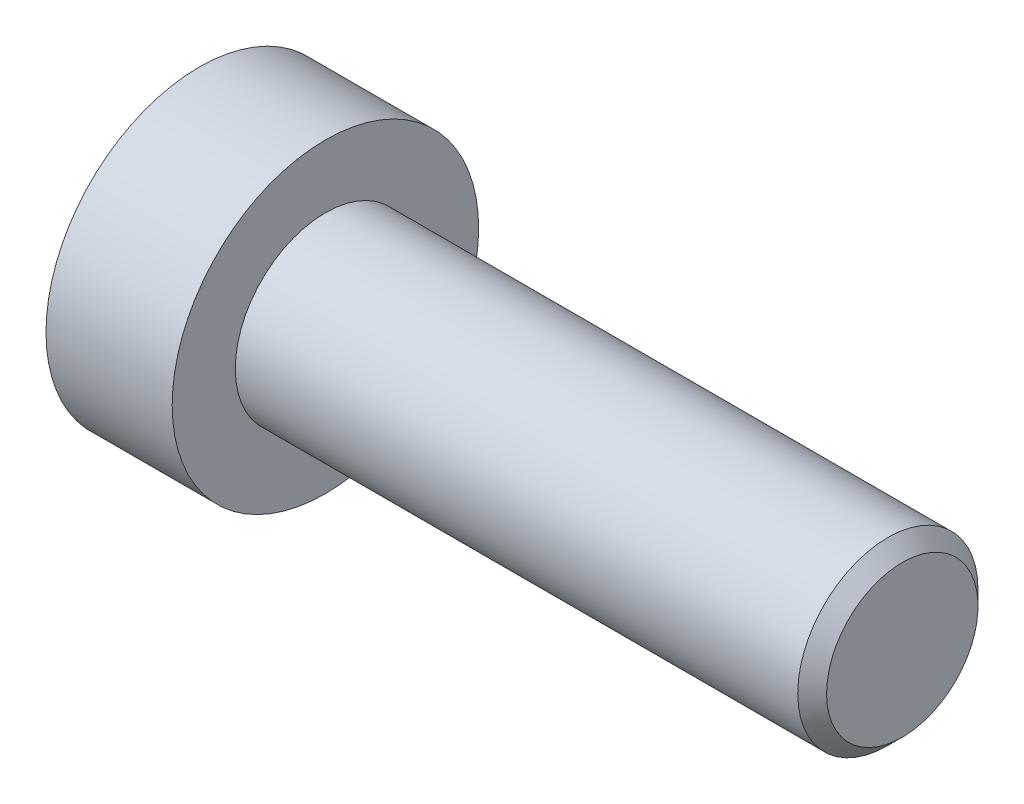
ISO-10303-21;
HEADER;
FILE_DESCRIPTION(('STEP AP214'),'2;1');
FILE_NAME('part.step','',(''),(''),'','','');
FILE_SCHEMA(('AUTOMOTIVE_DESIGN { 1 0 10303 214 1 1 1 1 }'));
ENDSEC;
DATA;
#1=APPLICATION_CONTEXT('core data for automotive mechanical design processes');
#2=APPLICATION_PROTOCOL_DEFINITION('international standard','automotive_design',2000,#1);
#3=PRODUCT_CONTEXT('',#1,'mechanical');
#4=PRODUCT('Part','Part','',(#3));
#5=PRODUCT_RELATED_PRODUCT_CATEGORY('part','',(#4));
#6=PRODUCT_DEFINITION_FORMATION('','',#4);
#7=PRODUCT_DEFINITION_CONTEXT('part definition',#1,'design');
#8=PRODUCT_DEFINITION('design','',#6,#7);
#9=PRODUCT_DEFINITION_SHAPE('','',#8);
#10=(LENGTH_UNIT() NAMED_UNIT(*) SI_UNIT(.MILLI.,.METRE.));
#11=(NAMED_UNIT(*) PLANE_ANGLE_UNIT() SI_UNIT($,.RADIAN.));
#12=(NAMED_UNIT(*) SI_UNIT($,.STERADIAN.) SOLID_ANGLE_UNIT());
#13=UNCERTAINTY_MEASURE_WITH_UNIT(LENGTH_MEASURE(1.E-05),#10,'distance_accuracy_value','');
#14=(GEOMETRIC_REPRESENTATION_CONTEXT(3) GLOBAL_UNCERTAINTY_ASSIGNED_CONTEXT((#13)) GLOBAL_UNIT_ASSIGNED_CONTEXT((#10,
#11,#12)) REPRESENTATION_CONTEXT('',''));
#15=CARTESIAN_POINT('',(0.,0.,0.));
#16=DIRECTION('',(0.,0.,1.));
#17=DIRECTION('',(1.,0.,0.));
#18=AXIS2_PLACEMENT_3D('',#15,#16,#17);
#19=CARTESIAN_POINT('',(-100.707422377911,37.694020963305,-9.09741678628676));
#20=DIRECTION('',(-1.,0.,0.));
#21=DIRECTION('',(0.,0.,1.));
#22=AXIS2_PLACEMENT_3D('',#19,#20,#21);
#23=CYLINDRICAL_SURFACE('',#22,0.394);
#24=CARTESIAN_POINT('',(-77.8,37.694020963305,-9.09741678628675));
#25=DIRECTION('',(-1.,0.,0.));
#26=DIRECTION('',(0.,0.,1.));
#27=AXIS2_PLACEMENT_3D('',#24,#25,#26);
#28=CIRCLE('',#27,0.394);
#29=CARTESIAN_POINT('',(-77.8,38.0713365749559,-8.98397548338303));
#30=VERTEX_POINT('',#29);
#31=CARTESIAN_POINT('',(-77.8,37.4071201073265,-9.36746103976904));
#32=VERTEX_POINT('',#31);
#33=EDGE_CURVE('E120',#30,#32,#28,.T.);
#34=ORIENTED_EDGE('',*,*,#33,.F.);
#35=DIRECTION('',(-1.,0.,0.));
#36=VECTOR('',#35,1.);
#37=CARTESIAN_POINT('',(-100.707422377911,38.0713365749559,-8.98397548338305));
#38=LINE('',#37,#36);
#39=CARTESIAN_POINT('',(-79.5,38.0713365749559,-8.98397548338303));
#40=VERTEX_POINT('',#39);
#41=EDGE_CURVE('E119',#40,#30,#38,.F.);
#42=ORIENTED_EDGE('',*,*,#41,.F.);
#43=CARTESIAN_POINT('',(-79.5,37.694020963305,-9.09741678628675));
#44=DIRECTION('',(-1.,0.,0.));
#45=DIRECTION('',(0.,0.,1.));
#46=AXIS2_PLACEMENT_3D('',#43,#44,#45);
#47=CIRCLE('',#46,0.394);
#48=CARTESIAN_POINT('',(-79.5,37.4071201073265,-9.36746103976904));
#49=VERTEX_POINT('',#48);
#50=EDGE_CURVE('E21',#49,#40,#47,.F.);
#51=ORIENTED_EDGE('',*,*,#50,.F.);
#52=DIRECTION('',(-1.,0.,0.));
#53=VECTOR('',#52,1.);
#54=CARTESIAN_POINT('',(-100.707422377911,37.4071201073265,-9.36746103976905));
#55=LINE('',#54,#53);
#56=EDGE_CURVE('E125',#32,#49,#55,.T.);
#57=ORIENTED_EDGE('',*,*,#56,.F.);
#58=EDGE_LOOP('',(#34,#42,#51,#57));
#59=FACE_BOUND('',#58,.T.);
#60=ADVANCED_FACE('F17',(#59),#23,.F.);
#61=CARTESIAN_POINT('',(-100.707422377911,38.482020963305,-7.73256074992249));
#62=DIRECTION('',(-1.,0.,0.));
#63=DIRECTION('',(0.,0.,1.));
#64=AXIS2_PLACEMENT_3D('',#61,#62,#63);
#65=CYLINDRICAL_SURFACE('',#64,0.394);
#66=CARTESIAN_POINT('',(-77.8,38.482020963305,-7.73256074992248));
#67=DIRECTION('',(-1.,0.,0.));
#68=DIRECTION('',(0.,0.,1.));
#69=AXIS2_PLACEMENT_3D('',#66,#67,#68);
#70=CIRCLE('',#69,0.394);
#71=CARTESIAN_POINT('',(-77.8,38.5724357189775,-7.34907519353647));
#72=VERTEX_POINT('',#71);
#73=CARTESIAN_POINT('',(-77.8,38.5724357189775,-8.11604630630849));
#74=VERTEX_POINT('',#73);
#75=EDGE_CURVE('E164',#72,#74,#70,.T.);
#76=ORIENTED_EDGE('',*,*,#75,.F.);
#77=DIRECTION('',(-1.,0.,0.));
#78=VECTOR('',#77,1.);
#79=CARTESIAN_POINT('',(-100.707422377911,38.5724357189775,-7.34907519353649));
#80=LINE('',#79,#78);
#81=CARTESIAN_POINT('',(-79.5,38.5724357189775,-7.34907519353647));
#82=VERTEX_POINT('',#81);
#83=EDGE_CURVE('E159',#82,#72,#80,.F.);
#84=ORIENTED_EDGE('',*,*,#83,.F.);
#85=CARTESIAN_POINT('',(-79.5,38.482020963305,-7.73256074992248));
#86=DIRECTION('',(-1.,0.,0.));
#87=DIRECTION('',(0.,0.,1.));
#88=AXIS2_PLACEMENT_3D('',#85,#86,#87);
#89=CIRCLE('',#88,0.394);
#90=CARTESIAN_POINT('',(-79.5,38.5724357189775,-8.11604630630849));
#91=VERTEX_POINT('',#90);
#92=EDGE_CURVE('E117',#91,#82,#89,.F.);
#93=ORIENTED_EDGE('',*,*,#92,.F.);
#94=DIRECTION('',(-1.,0.,0.));
#95=VECTOR('',#94,1.);
#96=CARTESIAN_POINT('',(-100.707422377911,38.5724357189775,-8.11604630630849));
#97=LINE('',#96,#95);
#98=EDGE_CURVE('E130',#74,#91,#97,.T.);
#99=ORIENTED_EDGE('',*,*,#98,.F.);
#100=EDGE_LOOP('',(#76,#84,#93,#99));
#101=FACE_BOUND('',#100,.T.);
#102=ADVANCED_FACE('F182',(#101),#65,.F.);
#103=CARTESIAN_POINT('',(-100.707422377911,37.694020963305,-6.36770471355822));
#104=DIRECTION('',(-1.,0.,0.));
#105=DIRECTION('',(0.,0.,1.));
#106=AXIS2_PLACEMENT_3D('',#103,#104,#105);
#107=CYLINDRICAL_SURFACE('',#106,0.394);
#108=CARTESIAN_POINT('',(-77.8,37.694020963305,-6.36770471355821));
#109=DIRECTION('',(-1.,0.,0.));
#110=DIRECTION('',(0.,0.,1.));
#111=AXIS2_PLACEMENT_3D('',#108,#109,#110);
#112=CIRCLE('',#111,0.394);
#113=CARTESIAN_POINT('',(-77.8,37.4071201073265,-6.0976604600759));
#114=VERTEX_POINT('',#113);
#115=CARTESIAN_POINT('',(-77.8,38.0713365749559,-6.48114601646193));
#116=VERTEX_POINT('',#115);
#117=EDGE_CURVE('E166',#114,#116,#112,.T.);
#118=ORIENTED_EDGE('',*,*,#117,.F.);
#119=DIRECTION('',(-1.,0.,0.));
#120=VECTOR('',#119,1.);
#121=CARTESIAN_POINT('',(-100.707422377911,37.4071201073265,-6.09766046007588));
#122=LINE('',#121,#120);
#123=CARTESIAN_POINT('',(-79.5,37.4071201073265,-6.0976604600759));
#124=VERTEX_POINT('',#123);
#125=EDGE_CURVE('E154',#124,#114,#122,.F.);
#126=ORIENTED_EDGE('',*,*,#125,.F.);
#127=CARTESIAN_POINT('',(-79.5,37.694020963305,-6.36770471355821));
#128=DIRECTION('',(-1.,0.,0.));
#129=DIRECTION('',(0.,0.,1.));
#130=AXIS2_PLACEMENT_3D('',#127,#128,#129);
#131=CIRCLE('',#130,0.394);
#132=CARTESIAN_POINT('',(-79.5,38.0713365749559,-6.48114601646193));
#133=VERTEX_POINT('',#132);
#134=EDGE_CURVE('E177',#133,#124,#131,.F.);
#135=ORIENTED_EDGE('',*,*,#134,.F.);
#136=DIRECTION('',(-1.,0.,0.));
#137=VECTOR('',#136,1.);
#138=CARTESIAN_POINT('',(-100.707422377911,38.0713365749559,-6.48114601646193));
#139=LINE('',#138,#137);
#140=EDGE_CURVE('E158',#116,#133,#139,.T.);
#141=ORIENTED_EDGE('',*,*,#140,.F.);
#142=EDGE_LOOP('',(#118,#126,#135,#141));
#143=FACE_BOUND('',#142,.T.);
#144=ADVANCED_FACE('F255',(#143),#107,.F.);
#145=CARTESIAN_POINT('',(-100.707422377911,36.1180209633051,-6.36770471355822));
#146=DIRECTION('',(-1.,0.,0.));
#147=DIRECTION('',(0.,0.,1.));
#148=AXIS2_PLACEMENT_3D('',#145,#146,#147);
#149=CYLINDRICAL_SURFACE('',#148,0.394);
#150=CARTESIAN_POINT('',(-77.8,36.1180209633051,-6.36770471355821));
#151=DIRECTION('',(-1.,0.,0.));
#152=DIRECTION('',(0.,0.,1.));
#153=AXIS2_PLACEMENT_3D('',#150,#151,#152);
#154=CIRCLE('',#153,0.394);
#155=CARTESIAN_POINT('',(-77.8,35.7407053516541,-6.48114601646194));
#156=VERTEX_POINT('',#155);
#157=CARTESIAN_POINT('',(-77.8,36.4049218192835,-6.09766046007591));
#158=VERTEX_POINT('',#157);
#159=EDGE_CURVE('E168',#156,#158,#154,.T.);
#160=ORIENTED_EDGE('',*,*,#159,.F.);
#161=DIRECTION('',(-1.,0.,0.));
#162=VECTOR('',#161,1.);
#163=CARTESIAN_POINT('',(-100.707422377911,35.7407053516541,-6.48114601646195));
#164=LINE('',#163,#162);
#165=CARTESIAN_POINT('',(-79.5,35.7407053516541,-6.48114601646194));
#166=VERTEX_POINT('',#165);
#167=EDGE_CURVE('E149',#166,#156,#164,.F.);
#168=ORIENTED_EDGE('',*,*,#167,.F.);
#169=CARTESIAN_POINT('',(-79.5,36.1180209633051,-6.36770471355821));
#170=DIRECTION('',(-1.,0.,0.));
#171=DIRECTION('',(0.,0.,1.));
#172=AXIS2_PLACEMENT_3D('',#169,#170,#171);
#173=CIRCLE('',#172,0.394);
#174=CARTESIAN_POINT('',(-79.5,36.4049218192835,-6.09766046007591));
#175=VERTEX_POINT('',#174);
#176=EDGE_CURVE('E175',#175,#166,#173,.F.);
#177=ORIENTED_EDGE('',*,*,#176,.F.);
#178=DIRECTION('',(-1.,0.,0.));
#179=VECTOR('',#178,1.);
#180=CARTESIAN_POINT('',(-100.707422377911,36.4049218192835,-6.09766046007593));
#181=LINE('',#180,#179);
#182=EDGE_CURVE('E153',#158,#175,#181,.T.);
#183=ORIENTED_EDGE('',*,*,#182,.F.);
#184=EDGE_LOOP('',(#160,#168,#177,#183));
#185=FACE_BOUND('',#184,.T.);
#186=ADVANCED_FACE('F253',(#185),#149,.F.);
#187=CARTESIAN_POINT('',(-100.707422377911,35.3300209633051,-7.73256074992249));
#188=DIRECTION('',(-1.,0.,0.));
#189=DIRECTION('',(0.,0.,1.));
#190=AXIS2_PLACEMENT_3D('',#187,#188,#189);
#191=CYLINDRICAL_SURFACE('',#190,0.394);
#192=CARTESIAN_POINT('',(-77.8,35.3300209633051,-7.73256074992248));
#193=DIRECTION('',(-1.,0.,0.));
#194=DIRECTION('',(0.,0.,1.));
#195=AXIS2_PLACEMENT_3D('',#192,#193,#194);
#196=CIRCLE('',#195,0.394);
#197=CARTESIAN_POINT('',(-77.8,35.2396062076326,-8.1160463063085));
#198=VERTEX_POINT('',#197);
#199=CARTESIAN_POINT('',(-77.8,35.2396062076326,-7.34907519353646));
#200=VERTEX_POINT('',#199);
#201=EDGE_CURVE('E170',#198,#200,#196,.T.);
#202=ORIENTED_EDGE('',*,*,#201,.F.);
#203=DIRECTION('',(-1.,0.,0.));
#204=VECTOR('',#203,1.);
#205=CARTESIAN_POINT('',(-100.707422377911,35.2396062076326,-8.11604630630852));
#206=LINE('',#205,#204);
#207=CARTESIAN_POINT('',(-79.5,35.2396062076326,-8.1160463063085));
#208=VERTEX_POINT('',#207);
#209=EDGE_CURVE('E144',#208,#198,#206,.F.);
#210=ORIENTED_EDGE('',*,*,#209,.F.);
#211=CARTESIAN_POINT('',(-79.5,35.3300209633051,-7.73256074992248));
#212=DIRECTION('',(-1.,0.,0.));
#213=DIRECTION('',(0.,0.,1.));
#214=AXIS2_PLACEMENT_3D('',#211,#212,#213);
#215=CIRCLE('',#214,0.394);
#216=CARTESIAN_POINT('',(-79.5,35.2396062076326,-7.34907519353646));
#217=VERTEX_POINT('',#216);
#218=EDGE_CURVE('E173',#217,#208,#215,.F.);
#219=ORIENTED_EDGE('',*,*,#218,.F.);
#220=DIRECTION('',(-1.,0.,0.));
#221=VECTOR('',#220,1.);
#222=CARTESIAN_POINT('',(-100.707422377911,35.2396062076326,-7.34907519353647));
#223=LINE('',#222,#221);
#224=EDGE_CURVE('E148',#200,#217,#223,.T.);
#225=ORIENTED_EDGE('',*,*,#224,.F.);
#226=EDGE_LOOP('',(#202,#210,#219,#225));
#227=FACE_BOUND('',#226,.T.);
#228=ADVANCED_FACE('F247',(#227),#191,.F.);
#229=CARTESIAN_POINT('',(-77.8,37.300020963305,-9.46826766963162));
#230=DIRECTION('',(-1.,0.,0.));
#231=DIRECTION('',(0.,0.,1.));
#232=AXIS2_PLACEMENT_3D('',#229,#230,#231);
#233=PLANE('',#232);
#234=ORIENTED_EDGE('',*,*,#75,.T.);
#235=CARTESIAN_POINT('',(-77.8,38.7303535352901,-8.78583965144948));
#236=DIRECTION('',(-1.,0.,0.));
#237=DIRECTION('',(0.,0.,1.));
#238=AXIS2_PLACEMENT_3D('',#235,#236,#237);
#239=CIRCLE('',#238,0.688157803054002);
#240=EDGE_CURVE('E124',#30,#74,#239,.T.);
#241=ORIENTED_EDGE('',*,*,#240,.F.);
#242=ORIENTED_EDGE('',*,*,#33,.T.);
#243=CARTESIAN_POINT('',(-77.8,36.906020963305,-9.83911855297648));
#244=DIRECTION('',(-1.,0.,0.));
#245=DIRECTION('',(0.,0.,1.));
#246=AXIS2_PLACEMENT_3D('',#243,#244,#245);
#247=CIRCLE('',#246,0.688157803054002);
#248=CARTESIAN_POINT('',(-77.8,36.4049218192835,-9.36746103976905));
#249=VERTEX_POINT('',#248);
#250=EDGE_CURVE('E161',#249,#32,#247,.T.);
#251=ORIENTED_EDGE('',*,*,#250,.F.);
#252=CARTESIAN_POINT('',(-77.8,36.1180209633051,-9.09741678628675));
#253=DIRECTION('',(-1.,0.,0.));
#254=DIRECTION('',(0.,0.,1.));
#255=AXIS2_PLACEMENT_3D('',#252,#253,#254);
#256=CIRCLE('',#255,0.394);
#257=CARTESIAN_POINT('',(-77.8,35.7407053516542,-8.98397548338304));
#258=VERTEX_POINT('',#257);
#259=EDGE_CURVE('E139',#249,#258,#256,.T.);
#260=ORIENTED_EDGE('',*,*,#259,.T.);
#261=CARTESIAN_POINT('',(-77.8,35.0816883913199,-8.78583965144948));
#262=DIRECTION('',(-1.,0.,0.));
#263=DIRECTION('',(0.,0.,1.));
#264=AXIS2_PLACEMENT_3D('',#261,#262,#263);
#265=CIRCLE('',#264,0.688157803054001);
#266=EDGE_CURVE('E142',#198,#258,#265,.T.);
#267=ORIENTED_EDGE('',*,*,#266,.F.);
#268=ORIENTED_EDGE('',*,*,#201,.T.);
#269=CARTESIAN_POINT('',(-77.8,35.0816883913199,-6.67928184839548));
#270=DIRECTION('',(-1.,0.,0.));
#271=DIRECTION('',(0.,0.,1.));
#272=AXIS2_PLACEMENT_3D('',#269,#270,#271);
#273=CIRCLE('',#272,0.688157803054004);
#274=EDGE_CURVE('E145',#156,#200,#273,.T.);
#275=ORIENTED_EDGE('',*,*,#274,.F.);
#276=ORIENTED_EDGE('',*,*,#159,.T.);
#277=CARTESIAN_POINT('',(-77.8,36.906020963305,-5.62600294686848));
#278=DIRECTION('',(-1.,0.,0.));
#279=DIRECTION('',(0.,0.,1.));
#280=AXIS2_PLACEMENT_3D('',#277,#278,#279);
#281=CIRCLE('',#280,0.688157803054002);
#282=EDGE_CURVE('E150',#114,#158,#281,.T.);
#283=ORIENTED_EDGE('',*,*,#282,.F.);
#284=ORIENTED_EDGE('',*,*,#117,.T.);
#285=CARTESIAN_POINT('',(-77.8,38.7303535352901,-6.67928184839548));
#286=DIRECTION('',(-1.,0.,0.));
#287=DIRECTION('',(0.,0.,1.));
#288=AXIS2_PLACEMENT_3D('',#285,#286,#287);
#289=CIRCLE('',#288,0.688157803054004);
#290=EDGE_CURVE('E155',#72,#116,#289,.T.);
#291=ORIENTED_EDGE('',*,*,#290,.F.);
#292=EDGE_LOOP('',(#234,#241,#242,#251,#260,#267,#268,#275,#276,#283,#284,#291));
#293=FACE_BOUND('',#292,.T.);
#294=ADVANCED_FACE('F243',(#293),#233,.T.);
#295=CARTESIAN_POINT('',(-100.707422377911,36.906020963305,-9.83911855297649));
#296=DIRECTION('',(-1.,0.,0.));
#297=DIRECTION('',(0.,0.,1.));
#298=AXIS2_PLACEMENT_3D('',#295,#296,#297);
#299=CYLINDRICAL_SURFACE('',#298,0.688157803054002);
#300=ORIENTED_EDGE('',*,*,#56,.T.);
#301=CARTESIAN_POINT('',(-79.5,36.906020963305,-9.83911855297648));
#302=DIRECTION('',(-1.,0.,0.));
#303=DIRECTION('',(0.,0.,1.));
#304=AXIS2_PLACEMENT_3D('',#301,#302,#303);
#305=CIRCLE('',#304,0.688157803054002);
#306=CARTESIAN_POINT('',(-79.5,36.4049218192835,-9.36746103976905));
#307=VERTEX_POINT('',#306);
#308=EDGE_CURVE('E116',#307,#49,#305,.T.);
#309=ORIENTED_EDGE('',*,*,#308,.F.);
#310=DIRECTION('',(-1.,0.,0.));
#311=VECTOR('',#310,1.);
#312=CARTESIAN_POINT('',(-100.707422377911,36.4049218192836,-9.3674610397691));
#313=LINE('',#312,#311);
#314=EDGE_CURVE('E141',#307,#249,#313,.F.);
#315=ORIENTED_EDGE('',*,*,#314,.T.);
#316=ORIENTED_EDGE('',*,*,#250,.T.);
#317=EDGE_LOOP('',(#300,#309,#315,#316));
#318=FACE_BOUND('',#317,.T.);
#319=ADVANCED_FACE('F238',(#318),#299,.T.);
#320=CARTESIAN_POINT('',(-100.707422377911,38.7303535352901,-8.78583965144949));
#321=DIRECTION('',(-1.,0.,0.));
#322=DIRECTION('',(0.,0.,1.));
#323=AXIS2_PLACEMENT_3D('',#320,#321,#322);
#324=CYLINDRICAL_SURFACE('',#323,0.688157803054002);
#325=ORIENTED_EDGE('',*,*,#98,.T.);
#326=CARTESIAN_POINT('',(-79.5,38.7303535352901,-8.78583965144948));
#327=DIRECTION('',(-1.,0.,0.));
#328=DIRECTION('',(0.,0.,1.));
#329=AXIS2_PLACEMENT_3D('',#326,#327,#328);
#330=CIRCLE('',#329,0.688157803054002);
#331=EDGE_CURVE('E114',#40,#91,#330,.T.);
#332=ORIENTED_EDGE('',*,*,#331,.F.);
#333=ORIENTED_EDGE('',*,*,#41,.T.);
#334=ORIENTED_EDGE('',*,*,#240,.T.);
#335=EDGE_LOOP('',(#325,#332,#333,#334));
#336=FACE_BOUND('',#335,.T.);
#337=ADVANCED_FACE('F128',(#336),#324,.T.);
#338=CARTESIAN_POINT('',(-100.707422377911,38.7303535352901,-6.67928184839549));
#339=DIRECTION('',(-1.,0.,0.));
#340=DIRECTION('',(0.,0.,1.));
#341=AXIS2_PLACEMENT_3D('',#338,#339,#340);
#342=CYLINDRICAL_SURFACE('',#341,0.688157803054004);
#343=ORIENTED_EDGE('',*,*,#140,.T.);
#344=CARTESIAN_POINT('',(-79.5,38.7303535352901,-6.67928184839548));
#345=DIRECTION('',(-1.,0.,0.));
#346=DIRECTION('',(0.,0.,1.));
#347=AXIS2_PLACEMENT_3D('',#344,#345,#346);
#348=CIRCLE('',#347,0.688157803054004);
#349=EDGE_CURVE('E131',#82,#133,#348,.T.);
#350=ORIENTED_EDGE('',*,*,#349,.F.);
#351=ORIENTED_EDGE('',*,*,#83,.T.);
#352=ORIENTED_EDGE('',*,*,#290,.T.);
#353=EDGE_LOOP('',(#343,#350,#351,#352));
#354=FACE_BOUND('',#353,.T.);
#355=ADVANCED_FACE('F187',(#354),#342,.T.);
#356=CARTESIAN_POINT('',(-100.707422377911,36.906020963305,-5.62600294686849));
#357=DIRECTION('',(-1.,0.,0.));
#358=DIRECTION('',(0.,0.,1.));
#359=AXIS2_PLACEMENT_3D('',#356,#357,#358);
#360=CYLINDRICAL_SURFACE('',#359,0.688157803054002);
#361=ORIENTED_EDGE('',*,*,#182,.T.);
#362=CARTESIAN_POINT('',(-79.5,36.906020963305,-5.62600294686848));
#363=DIRECTION('',(-1.,0.,0.));
#364=DIRECTION('',(0.,0.,1.));
#365=AXIS2_PLACEMENT_3D('',#362,#363,#364);
#366=CIRCLE('',#365,0.688157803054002);
#367=EDGE_CURVE('E134',#124,#175,#366,.T.);
#368=ORIENTED_EDGE('',*,*,#367,.F.);
#369=ORIENTED_EDGE('',*,*,#125,.T.);
#370=ORIENTED_EDGE('',*,*,#282,.T.);
#371=EDGE_LOOP('',(#361,#368,#369,#370));
#372=FACE_BOUND('',#371,.T.);
#373=ADVANCED_FACE('F220',(#372),#360,.T.);
#374=CARTESIAN_POINT('',(-100.707422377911,35.0816883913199,-6.67928184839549));
#375=DIRECTION('',(-1.,0.,0.));
#376=DIRECTION('',(0.,0.,1.));
#377=AXIS2_PLACEMENT_3D('',#374,#375,#376);
#378=CYLINDRICAL_SURFACE('',#377,0.688157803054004);
#379=ORIENTED_EDGE('',*,*,#224,.T.);
#380=CARTESIAN_POINT('',(-79.5,35.0816883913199,-6.67928184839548));
#381=DIRECTION('',(-1.,0.,0.));
#382=DIRECTION('',(0.,0.,1.));
#383=AXIS2_PLACEMENT_3D('',#380,#381,#382);
#384=CIRCLE('',#383,0.688157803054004);
#385=EDGE_CURVE('E212',#166,#217,#384,.T.);
#386=ORIENTED_EDGE('',*,*,#385,.F.);
#387=ORIENTED_EDGE('',*,*,#167,.T.);
#388=ORIENTED_EDGE('',*,*,#274,.T.);
#389=EDGE_LOOP('',(#379,#386,#387,#388));
#390=FACE_BOUND('',#389,.T.);
#391=ADVANCED_FACE('F252',(#390),#378,.T.);
#392=CARTESIAN_POINT('',(-100.707422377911,35.0816883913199,-8.78583965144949));
#393=DIRECTION('',(-1.,0.,0.));
#394=DIRECTION('',(0.,0.,1.));
#395=AXIS2_PLACEMENT_3D('',#392,#393,#394);
#396=CYLINDRICAL_SURFACE('',#395,0.688157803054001);
#397=DIRECTION('',(-1.,0.,0.));
#398=VECTOR('',#397,1.);
#399=CARTESIAN_POINT('',(-100.707422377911,35.7407053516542,-8.98397548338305));
#400=LINE('',#399,#398);
#401=CARTESIAN_POINT('',(-79.5,35.7407053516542,-8.98397548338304));
#402=VERTEX_POINT('',#401);
#403=EDGE_CURVE('E36',#258,#402,#400,.T.);
#404=ORIENTED_EDGE('',*,*,#403,.T.);
#405=CARTESIAN_POINT('',(-79.5,35.0816883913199,-8.78583965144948));
#406=DIRECTION('',(-1.,0.,0.));
#407=DIRECTION('',(0.,0.,1.));
#408=AXIS2_PLACEMENT_3D('',#405,#406,#407);
#409=CIRCLE('',#408,0.688157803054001);
#410=EDGE_CURVE('E210',#208,#402,#409,.T.);
#411=ORIENTED_EDGE('',*,*,#410,.F.);
#412=ORIENTED_EDGE('',*,*,#209,.T.);
#413=ORIENTED_EDGE('',*,*,#266,.T.);
#414=EDGE_LOOP('',(#404,#411,#412,#413));
#415=FACE_BOUND('',#414,.T.);
#416=ADVANCED_FACE('F244',(#415),#396,.T.);
#417=CARTESIAN_POINT('',(-100.707422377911,36.1180209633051,-9.09741678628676));
#418=DIRECTION('',(-1.,0.,0.));
#419=DIRECTION('',(0.,0.,1.));
#420=AXIS2_PLACEMENT_3D('',#417,#418,#419);
#421=CYLINDRICAL_SURFACE('',#420,0.394);
#422=ORIENTED_EDGE('',*,*,#259,.F.);
#423=ORIENTED_EDGE('',*,*,#314,.F.);
#424=CARTESIAN_POINT('',(-79.5,36.1180209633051,-9.09741678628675));
#425=DIRECTION('',(-1.,0.,0.));
#426=DIRECTION('',(0.,0.,1.));
#427=AXIS2_PLACEMENT_3D('',#424,#425,#426);
#428=CIRCLE('',#427,0.394);
#429=EDGE_CURVE('E208',#402,#307,#428,.F.);
#430=ORIENTED_EDGE('',*,*,#429,.F.);
#431=ORIENTED_EDGE('',*,*,#403,.F.);
#432=EDGE_LOOP('',(#422,#423,#430,#431));
#433=FACE_BOUND('',#432,.T.);
#434=ADVANCED_FACE('F240',(#433),#421,.F.);
#435=CARTESIAN_POINT('',(-79.5,36.906020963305,-7.73256074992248));
#436=DIRECTION('',(-1.,0.,0.));
#437=DIRECTION('',(0.,0.,1.));
#438=AXIS2_PLACEMENT_3D('',#435,#436,#437);
#439=PLANE('',#438);
#440=ORIENTED_EDGE('',*,*,#410,.T.);
#441=ORIENTED_EDGE('',*,*,#429,.T.);
#442=ORIENTED_EDGE('',*,*,#308,.T.);
#443=ORIENTED_EDGE('',*,*,#50,.T.);
#444=ORIENTED_EDGE('',*,*,#331,.T.);
#445=ORIENTED_EDGE('',*,*,#92,.T.);
#446=ORIENTED_EDGE('',*,*,#349,.T.);
#447=ORIENTED_EDGE('',*,*,#134,.T.);
#448=ORIENTED_EDGE('',*,*,#367,.T.);
#449=ORIENTED_EDGE('',*,*,#176,.T.);
#450=ORIENTED_EDGE('',*,*,#385,.T.);
#451=ORIENTED_EDGE('',*,*,#218,.T.);
#452=EDGE_LOOP('',(#440,#441,#442,#443,#444,#445,#446,#447,#448,#449,#450,#451));
#453=FACE_BOUND('',#452,.T.);
#454=CARTESIAN_POINT('',(-79.5,36.906020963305,-7.73256074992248));
#455=DIRECTION('',(1.,0.,0.));
#456=DIRECTION('',(0.,0.,-1.));
#457=AXIS2_PLACEMENT_3D('',#454,#455,#456);
#458=CIRCLE('',#457,4.25);
#459=CARTESIAN_POINT('',(-79.5,36.906020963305,-11.9825607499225));
#460=VERTEX_POINT('',#459);
#461=EDGE_CURVE('E205',#460,#460,#458,.T.);
#462=ORIENTED_EDGE('',*,*,#461,.F.);
#463=EDGE_LOOP('',(#462));
#464=FACE_BOUND('',#463,.T.);
#465=ADVANCED_FACE('F111',(#453,#464),#439,.T.);
#466=CARTESIAN_POINT('',(-76.,36.906020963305,-7.73256074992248));
#467=DIRECTION('',(1.,0.,0.));
#468=DIRECTION('',(0.,0.,-1.));
#469=AXIS2_PLACEMENT_3D('',#466,#467,#468);
#470=CYLINDRICAL_SURFACE('',#469,4.25);
#471=CARTESIAN_POINT('',(-76.,36.906020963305,-7.73256074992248));
#472=DIRECTION('',(1.,0.,0.));
#473=DIRECTION('',(0.,0.,-1.));
#474=AXIS2_PLACEMENT_3D('',#471,#472,#473);
#475=CIRCLE('',#474,4.25);
#476=CARTESIAN_POINT('',(-76.,36.906020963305,-11.9825607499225));
#477=VERTEX_POINT('',#476);
#478=EDGE_CURVE('E202',#477,#477,#475,.T.);
#479=ORIENTED_EDGE('',*,*,#478,.F.);
#480=EDGE_LOOP('',(#479));
#481=FACE_BOUND('',#480,.T.);
#482=ORIENTED_EDGE('',*,*,#461,.T.);
#483=EDGE_LOOP('',(#482));
#484=FACE_BOUND('',#483,.T.);
#485=ADVANCED_FACE('F282',(#481,#484),#470,.T.);
#486=CARTESIAN_POINT('',(-60.,36.906020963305,-7.73256074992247));
#487=DIRECTION('',(-1.,0.,0.));
#488=DIRECTION('',(0.,0.,1.));
#489=AXIS2_PLACEMENT_3D('',#486,#487,#488);
#490=PLANE('',#489);
#491=CARTESIAN_POINT('',(-60.0000000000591,36.906020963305,-7.73256074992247));
#492=DIRECTION('',(-1.,0.,0.));
#493=DIRECTION('',(0.,0.,1.));
#494=AXIS2_PLACEMENT_3D('',#491,#492,#493);
#495=CIRCLE('',#494,2.10000000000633);
#496=CARTESIAN_POINT('',(-60.0000000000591,36.906020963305,-5.63256074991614));
#497=VERTEX_POINT('',#496);
#498=EDGE_CURVE('E199',#497,#497,#495,.T.);
#499=ORIENTED_EDGE('',*,*,#498,.F.);
#500=EDGE_LOOP('',(#499));
#501=FACE_BOUND('',#500,.T.);
#502=ADVANCED_FACE('F278',(#501),#490,.F.);
#503=CARTESIAN_POINT('',(-76.,36.906020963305,-7.73256074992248));
#504=DIRECTION('',(1.,0.,0.));
#505=DIRECTION('',(0.,0.,-1.));
#506=AXIS2_PLACEMENT_3D('',#503,#504,#505);
#507=PLANE('',#506);
#508=CARTESIAN_POINT('',(-76.,36.906020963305,-7.73256074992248));
#509=DIRECTION('',(-1.,0.,0.));
#510=DIRECTION('',(0.,0.,1.));
#511=AXIS2_PLACEMENT_3D('',#508,#509,#510);
#512=CIRCLE('',#511,2.5);
#513=CARTESIAN_POINT('',(-76.,36.906020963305,-5.23256074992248));
#514=VERTEX_POINT('',#513);
#515=EDGE_CURVE('E27',#514,#514,#512,.F.);
#516=ORIENTED_EDGE('',*,*,#515,.F.);
#517=EDGE_LOOP('',(#516));
#518=FACE_BOUND('',#517,.T.);
#519=ORIENTED_EDGE('',*,*,#478,.T.);
#520=EDGE_LOOP('',(#519));
#521=FACE_BOUND('',#520,.T.);
#522=ADVANCED_FACE('F270',(#518,#521),#507,.T.);
#523=CARTESIAN_POINT('',(-60.4000000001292,36.906020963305,-7.73256074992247));
#524=DIRECTION('',(-1.,0.,0.));
#525=DIRECTION('',(0.,0.,1.));
#526=AXIS2_PLACEMENT_3D('',#523,#524,#525);
#527=CONICAL_SURFACE('',#526,2.50000000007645,0.785398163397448);
#528=CARTESIAN_POINT('',(-60.4,36.906020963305,-7.73256074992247));
#529=DIRECTION('',(-1.,0.,0.));
#530=DIRECTION('',(0.,0.,1.));
#531=AXIS2_PLACEMENT_3D('',#528,#529,#530);
#532=CIRCLE('',#531,2.5);
#533=CARTESIAN_POINT('',(-60.4,36.906020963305,-5.23256074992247));
#534=VERTEX_POINT('',#533);
#535=EDGE_CURVE('E11',#534,#534,#532,.T.);
#536=ORIENTED_EDGE('',*,*,#535,.F.);
#537=EDGE_LOOP('',(#536));
#538=FACE_BOUND('',#537,.T.);
#539=ORIENTED_EDGE('',*,*,#498,.T.);
#540=EDGE_LOOP('',(#539));
#541=FACE_BOUND('',#540,.T.);
#542=ADVANCED_FACE('F265',(#538,#541),#527,.T.);
#543=CARTESIAN_POINT('',(-82.9074223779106,36.906020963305,-7.73256074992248));
#544=DIRECTION('',(-1.,0.,0.));
#545=DIRECTION('',(0.,0.,1.));
#546=AXIS2_PLACEMENT_3D('',#543,#544,#545);
#547=CYLINDRICAL_SURFACE('',#546,2.5);
#548=ORIENTED_EDGE('',*,*,#535,.T.);
#549=EDGE_LOOP('',(#548));
#550=FACE_BOUND('',#549,.T.);
#551=ORIENTED_EDGE('',*,*,#515,.T.);
#552=EDGE_LOOP('',(#551));
#553=FACE_BOUND('',#552,.T.);
#554=ADVANCED_FACE('F19',(#550,#553),#547,.T.);
#555=CLOSED_SHELL('',(#60,#102,#144,#186,#228,#294,#319,#337,#355,#373,#391,#416,#434,#465,#485,
#502,#522,#542,#554));
#556=MANIFOLD_SOLID_BREP('B1',#555);
#557=ADVANCED_BREP_SHAPE_REPRESENTATION('',(#18,#556),#14);
#558=SHAPE_DEFINITION_REPRESENTATION(#9,#557);
ENDSEC;
END-ISO-10303-21;
